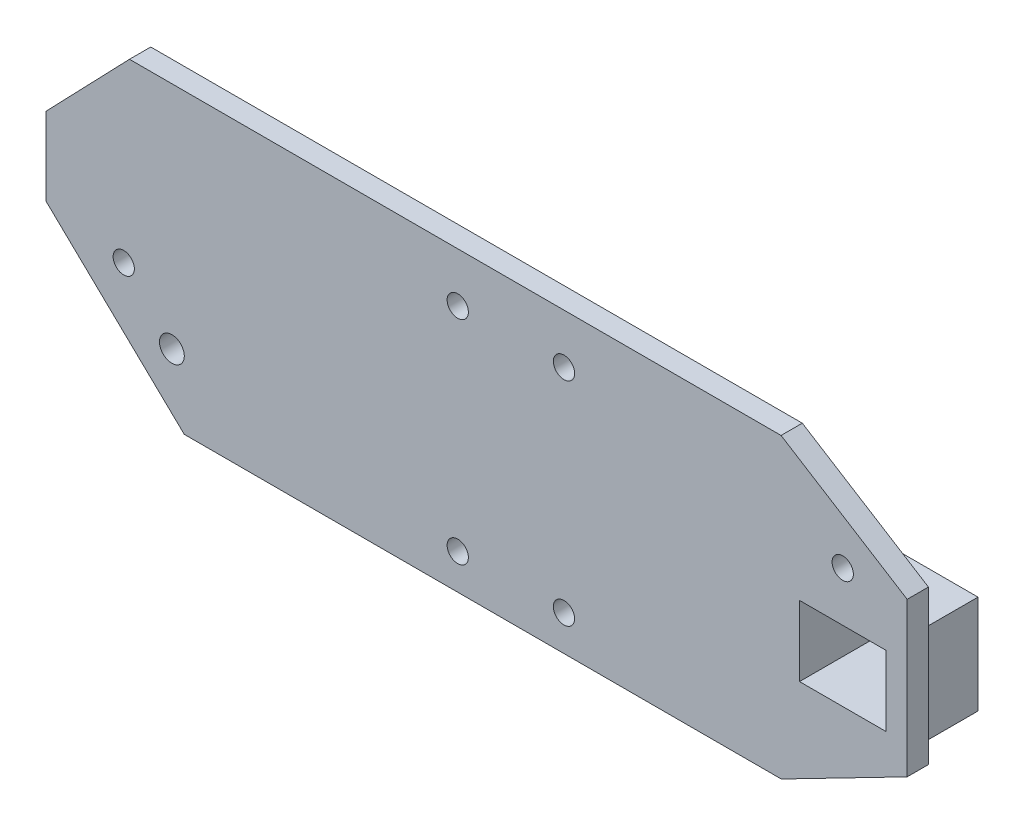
from build123d import *

# Parameters (mm, degrees)
BOSS_EXTRUDE1_DEPTH = 3
SKETCH2_R           = 1.5
SKETCH2_W           = 12.2
SKETCH2_H           = 9.93
CUT_EXTRUDE2_DEPTH  = 5
SKETCH4_R           = 1.5
CUT_EXTRUDE4_DEPTH  = 3
SKETCH5_W           = 16.2
SKETCH5_H           = 13.93
SKETCH5_W_2         = 12.2
SKETCH5_H_2         = 9.93
BOSS_EXTRUDE2_DEPTH = 8
SKETCH6_R           = 1.7526
SKETCH6_R_2         = 1.5
CUT_EXTRUDE5_DEPTH  = 5


with BuildPart() as part:
    # Sketch1 → Boss-Extrude1 (new body)
    with BuildSketch(Plane.XY):
        Polygon((-125.186603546, 38.874369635), (-33.186603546, 38.874369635), (-15.381249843, 27.740215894), (-15.381249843, 6.028295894), (-33.163376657, -3.125630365), (-117.453376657, -3.125630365), (-136.975246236, 15.625781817), (-136.975246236, 26.625781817), align=None)
    extrude(amount=BOSS_EXTRUDE1_DEPTH)

    # Sketch2 → Cut-Extrude2 (cut)
    with BuildSketch(Plane.XY.offset(3)):
        with Locations((-24.481249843, 27.009255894)):
            Circle(SKETCH2_R)
        with Locations((-24.481249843, 15.044255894)):
            Rectangle(SKETCH2_W, SKETCH2_H)
    extrude(amount=-CUT_EXTRUDE2_DEPTH, mode=Mode.SUBTRACT)

    # Sketch4 → Cut-Extrude4 (cut)
    with BuildSketch(Plane(origin=(0, 0, 0), x_dir=(-1, 0, 0), z_dir=(0, 0, -1))):
        with Locations((63.836603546, 31.874369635)):
            Circle(SKETCH4_R)
        with Locations((78.836603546, 31.874369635)):
            Circle(SKETCH4_R)
        with Locations((63.836603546, 1.874369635)):
            Circle(SKETCH4_R)
        with Locations((78.836603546, 1.874369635)):
            Circle(SKETCH4_R)
    extrude(amount=-CUT_EXTRUDE4_DEPTH, mode=Mode.SUBTRACT)

    # Sketch5 → Boss-Extrude2 (add)
    with BuildSketch(Plane(origin=(0, 0, 0), x_dir=(-1, 0, 0), z_dir=(0, 0, -1))):
        with Locations((24.481249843, 15.044255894)):
            Rectangle(SKETCH5_W, SKETCH5_H)
        with Locations((24.481249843, 15.044255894)):
            Rectangle(SKETCH5_W_2, SKETCH5_H_2, mode=Mode.SUBTRACT)
    extrude(amount=BOSS_EXTRUDE2_DEPTH)

    # Sketch6 → Cut-Extrude5 (cut)
    with BuildSketch(Plane(origin=(0, 0, 0), x_dir=(-1, 0, 0), z_dir=(0, 0, -1))):
        with Locations((119.199076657, 6.444369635)):
            Circle(SKETCH6_R)
        with Locations((125.998946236, 13.590281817)):
            Circle(SKETCH6_R_2)
    extrude(amount=-CUT_EXTRUDE5_DEPTH, mode=Mode.SUBTRACT)


solid = part.part
